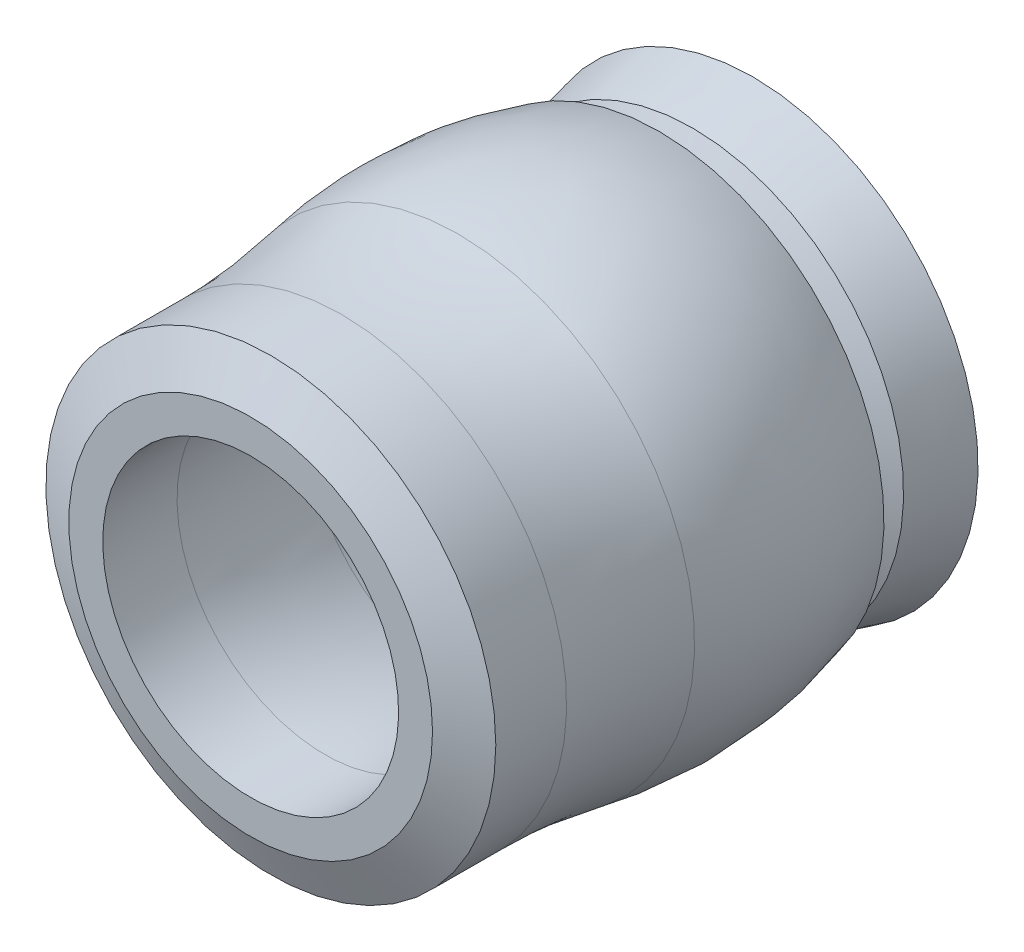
ISO-10303-21;
HEADER;
FILE_DESCRIPTION(('STEP AP214'),'2;1');
FILE_NAME('part.step','',(''),(''),'','','');
FILE_SCHEMA(('AUTOMOTIVE_DESIGN { 1 0 10303 214 1 1 1 1 }'));
ENDSEC;
DATA;
#1=APPLICATION_CONTEXT('core data for automotive mechanical design processes');
#2=APPLICATION_PROTOCOL_DEFINITION('international standard','automotive_design',2000,#1);
#3=PRODUCT_CONTEXT('',#1,'mechanical');
#4=PRODUCT('Part','Part','',(#3));
#5=PRODUCT_RELATED_PRODUCT_CATEGORY('part','',(#4));
#6=PRODUCT_DEFINITION_FORMATION('','',#4);
#7=PRODUCT_DEFINITION_CONTEXT('part definition',#1,'design');
#8=PRODUCT_DEFINITION('design','',#6,#7);
#9=PRODUCT_DEFINITION_SHAPE('','',#8);
#10=(LENGTH_UNIT() NAMED_UNIT(*) SI_UNIT(.MILLI.,.METRE.));
#11=(NAMED_UNIT(*) PLANE_ANGLE_UNIT() SI_UNIT($,.RADIAN.));
#12=(NAMED_UNIT(*) SI_UNIT($,.STERADIAN.) SOLID_ANGLE_UNIT());
#13=UNCERTAINTY_MEASURE_WITH_UNIT(LENGTH_MEASURE(1.E-05),#10,'distance_accuracy_value','');
#14=(GEOMETRIC_REPRESENTATION_CONTEXT(3) GLOBAL_UNCERTAINTY_ASSIGNED_CONTEXT((#13)) GLOBAL_UNIT_ASSIGNED_CONTEXT((#10,
#11,#12)) REPRESENTATION_CONTEXT('',''));
#15=CARTESIAN_POINT('',(0.,0.,0.));
#16=DIRECTION('',(0.,0.,1.));
#17=DIRECTION('',(1.,0.,0.));
#18=AXIS2_PLACEMENT_3D('',#15,#16,#17);
#19=CARTESIAN_POINT('',(0.,0.,3.61389850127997));
#20=DIRECTION('',(0.,0.,-1.));
#21=DIRECTION('',(0.,1.,0.));
#22=AXIS2_PLACEMENT_3D('',#19,#20,#21);
#23=TOROIDAL_SURFACE('',#22,7.366,1.27);
#24=CARTESIAN_POINT('',(0.,0.,3.61389850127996));
#25=DIRECTION('',(0.,0.,-1.));
#26=DIRECTION('',(0.,1.,0.));
#27=AXIS2_PLACEMENT_3D('',#24,#25,#26);
#28=CIRCLE('',#27,6.096);
#29=CARTESIAN_POINT('',(0.,6.096,3.61389850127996));
#30=VERTEX_POINT('',#29);
#31=EDGE_CURVE('E97',#30,#30,#28,.T.);
#32=ORIENTED_EDGE('',*,*,#31,.T.);
#33=EDGE_LOOP('',(#32));
#34=FACE_BOUND('',#33,.T.);
#35=CARTESIAN_POINT('',(0.,0.,3.99017181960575));
#36=DIRECTION('',(0.,0.,-1.));
#37=DIRECTION('',(0.,1.,0.));
#38=AXIS2_PLACEMENT_3D('',#35,#36,#37);
#39=CIRCLE('',#38,6.15302086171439);
#40=CARTESIAN_POINT('',(0.,6.15302086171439,3.99017181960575));
#41=VERTEX_POINT('',#40);
#42=EDGE_CURVE('E158',#41,#41,#39,.F.);
#43=ORIENTED_EDGE('',*,*,#42,.T.);
#44=EDGE_LOOP('',(#43));
#45=FACE_BOUND('',#44,.T.);
#46=ADVANCED_FACE('F12',(#34,#45),#23,.T.);
#47=CARTESIAN_POINT('',(0.,-9.64238390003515,8.89));
#48=DIRECTION('',(1.,0.,0.));
#49=DIRECTION('',(0.,1.,0.));
#50=AXIS2_PLACEMENT_3D('',#47,#48,#49);
#51=CIRCLE('',#50,16.5379299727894);
#52=TRIMMED_CURVE('',#51,(PARAMETER_VALUE(-0.948322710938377)),
(PARAMETER_VALUE(0.948322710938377)),.T.,.PARAMETER.);
#53=CARTESIAN_POINT('',(0.,0.,8.89));
#54=DIRECTION('',(0.,0.,-1.));
#55=AXIS1_PLACEMENT('',#53,#54);
#56=SURFACE_OF_REVOLUTION('',#52,#55);
#57=ORIENTED_EDGE('',*,*,#42,.F.);
#58=EDGE_LOOP('',(#57));
#59=FACE_BOUND('',#58,.T.);
#60=CARTESIAN_POINT('',(0.,0.,11.8870457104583));
#61=DIRECTION('',(0.,0.,-1.));
#62=DIRECTION('',(0.,1.,0.));
#63=AXIS2_PLACEMENT_3D('',#60,#61,#62);
#64=CIRCLE('',#63,6.62171290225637);
#65=CARTESIAN_POINT('',(0.,6.62171290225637,11.8870457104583));
#66=VERTEX_POINT('',#65);
#67=EDGE_CURVE('E94',#66,#66,#64,.T.);
#68=ORIENTED_EDGE('',*,*,#67,.F.);
#69=EDGE_LOOP('',(#68));
#70=FACE_BOUND('',#69,.T.);
#71=ADVANCED_FACE('F101',(#59,#70),#56,.T.);
#72=CARTESIAN_POINT('',(0.,0.,-2.63431461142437));
#73=DIRECTION('',(0.,0.,-1.));
#74=DIRECTION('',(0.,1.,0.));
#75=AXIS2_PLACEMENT_3D('',#72,#73,#74);
#76=CYLINDRICAL_SURFACE('',#75,6.096);
#77=CARTESIAN_POINT('',(0.,0.,3.53405823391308));
#78=DIRECTION('',(0.,0.,1.));
#79=DIRECTION('',(0.,-1.,0.));
#80=AXIS2_PLACEMENT_3D('',#77,#78,#79);
#81=CIRCLE('',#80,6.0959999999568);
#82=CARTESIAN_POINT('',(0.,-6.0959999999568,3.53405823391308));
#83=VERTEX_POINT('',#82);
#84=EDGE_CURVE('E91',#83,#83,#81,.F.);
#85=ORIENTED_EDGE('',*,*,#84,.T.);
#86=EDGE_LOOP('',(#85));
#87=FACE_BOUND('',#86,.T.);
#88=ORIENTED_EDGE('',*,*,#31,.F.);
#89=EDGE_LOOP('',(#88));
#90=FACE_BOUND('',#89,.T.);
#91=ADVANCED_FACE('F84',(#87,#90),#76,.F.);
#92=CARTESIAN_POINT('',(0.,0.,17.6408614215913));
#93=DIRECTION('',(0.,0.,-1.));
#94=DIRECTION('',(0.,1.,0.));
#95=AXIS2_PLACEMENT_3D('',#92,#93,#94);
#96=TOROIDAL_SURFACE('',#95,37.846,31.75);
#97=ORIENTED_EDGE('',*,*,#67,.T.);
#98=EDGE_LOOP('',(#97));
#99=FACE_BOUND('',#98,.T.);
#100=CARTESIAN_POINT('',(0.,0.,17.6408614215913));
#101=DIRECTION('',(0.,0.,-1.));
#102=DIRECTION('',(0.,1.,0.));
#103=AXIS2_PLACEMENT_3D('',#100,#101,#102);
#104=CIRCLE('',#103,6.096);
#105=CARTESIAN_POINT('',(0.,6.096,17.6408614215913));
#106=VERTEX_POINT('',#105);
#107=EDGE_CURVE('E89',#106,#106,#104,.F.);
#108=ORIENTED_EDGE('',*,*,#107,.T.);
#109=EDGE_LOOP('',(#108));
#110=FACE_BOUND('',#109,.T.);
#111=ADVANCED_FACE('F79',(#99,#110),#96,.T.);
#112=CARTESIAN_POINT('',(0.,0.,3.53405823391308));
#113=DIRECTION('',(0.,0.,1.));
#114=DIRECTION('',(0.,-1.,0.));
#115=AXIS2_PLACEMENT_3D('',#112,#113,#114);
#116=CONICAL_SURFACE('',#115,6.0959999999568,1.13446401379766);
#117=ORIENTED_EDGE('',*,*,#84,.F.);
#118=EDGE_LOOP('',(#117));
#119=FACE_BOUND('',#118,.T.);
#120=CARTESIAN_POINT('',(0.,0.,2.5273));
#121=DIRECTION('',(0.,0.,-1.));
#122=DIRECTION('',(0.,1.,0.));
#123=AXIS2_PLACEMENT_3D('',#120,#121,#122);
#124=CIRCLE('',#123,3.937);
#125=CARTESIAN_POINT('',(0.,3.937,2.5273));
#126=VERTEX_POINT('',#125);
#127=EDGE_CURVE('E138',#126,#126,#124,.T.);
#128=ORIENTED_EDGE('',*,*,#127,.T.);
#129=EDGE_LOOP('',(#128));
#130=FACE_BOUND('',#129,.T.);
#131=ADVANCED_FACE('F75',(#119,#130),#116,.F.);
#132=CARTESIAN_POINT('',(0.,0.,-2.63431461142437));
#133=DIRECTION('',(0.,0.,-1.));
#134=DIRECTION('',(0.,1.,0.));
#135=AXIS2_PLACEMENT_3D('',#132,#133,#134);
#136=CYLINDRICAL_SURFACE('',#135,6.096);
#137=ORIENTED_EDGE('',*,*,#107,.F.);
#138=EDGE_LOOP('',(#137));
#139=FACE_BOUND('',#138,.T.);
#140=CARTESIAN_POINT('',(0.,0.,20.701));
#141=DIRECTION('',(0.,0.,-1.));
#142=DIRECTION('',(0.,1.,0.));
#143=AXIS2_PLACEMENT_3D('',#140,#141,#142);
#144=CIRCLE('',#143,6.096);
#145=CARTESIAN_POINT('',(0.,6.096,20.701));
#146=VERTEX_POINT('',#145);
#147=EDGE_CURVE('E16',#146,#146,#144,.T.);
#148=ORIENTED_EDGE('',*,*,#147,.F.);
#149=EDGE_LOOP('',(#148));
#150=FACE_BOUND('',#149,.T.);
#151=ADVANCED_FACE('F71',(#139,#150),#136,.F.);
#152=CARTESIAN_POINT('',(0.,0.,-2.63431461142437));
#153=DIRECTION('',(0.,0.,-1.));
#154=DIRECTION('',(0.,1.,0.));
#155=AXIS2_PLACEMENT_3D('',#152,#153,#154);
#156=CYLINDRICAL_SURFACE('',#155,3.937);
#157=CARTESIAN_POINT('',(0.,0.,0.));
#158=DIRECTION('',(0.,0.,-1.));
#159=DIRECTION('',(0.,1.,0.));
#160=AXIS2_PLACEMENT_3D('',#157,#158,#159);
#161=CIRCLE('',#160,3.937);
#162=CARTESIAN_POINT('',(0.,3.937,0.));
#163=VERTEX_POINT('',#162);
#164=EDGE_CURVE('E143',#163,#163,#161,.F.);
#165=ORIENTED_EDGE('',*,*,#164,.F.);
#166=EDGE_LOOP('',(#165));
#167=FACE_BOUND('',#166,.T.);
#168=ORIENTED_EDGE('',*,*,#127,.F.);
#169=EDGE_LOOP('',(#168));
#170=FACE_BOUND('',#169,.T.);
#171=ADVANCED_FACE('F67',(#167,#170),#156,.F.);
#172=CARTESIAN_POINT('',(7.493,0.,20.701));
#173=DIRECTION('',(0.,0.,1.));
#174=DIRECTION('',(0.,-1.,0.));
#175=AXIS2_PLACEMENT_3D('',#172,#173,#174);
#176=PLANE('',#175);
#177=CARTESIAN_POINT('',(0.,0.,20.701));
#178=DIRECTION('',(0.,0.,-1.));
#179=DIRECTION('',(1.,0.,0.));
#180=AXIS2_PLACEMENT_3D('',#177,#178,#179);
#181=CIRCLE('',#180,7.493);
#182=CARTESIAN_POINT('',(7.493,0.,20.701));
#183=VERTEX_POINT('',#182);
#184=EDGE_CURVE('E151',#183,#183,#181,.T.);
#185=ORIENTED_EDGE('',*,*,#184,.F.);
#186=EDGE_LOOP('',(#185));
#187=FACE_BOUND('',#186,.T.);
#188=ORIENTED_EDGE('',*,*,#147,.T.);
#189=EDGE_LOOP('',(#188));
#190=FACE_BOUND('',#189,.T.);
#191=ADVANCED_FACE('F63',(#187,#190),#176,.T.);
#192=CARTESIAN_POINT('',(3.937,0.,0.));
#193=DIRECTION('',(0.,0.,-1.));
#194=DIRECTION('',(0.,1.,0.));
#195=AXIS2_PLACEMENT_3D('',#192,#193,#194);
#196=PLANE('',#195);
#197=ORIENTED_EDGE('',*,*,#164,.T.);
#198=EDGE_LOOP('',(#197));
#199=FACE_BOUND('',#198,.T.);
#200=CARTESIAN_POINT('',(0.,0.,0.));
#201=DIRECTION('',(0.,0.,-1.));
#202=DIRECTION('',(0.,1.,0.));
#203=AXIS2_PLACEMENT_3D('',#200,#201,#202);
#204=CIRCLE('',#203,9.271);
#205=CARTESIAN_POINT('',(0.,9.271,0.));
#206=VERTEX_POINT('',#205);
#207=EDGE_CURVE('E136',#206,#206,#204,.F.);
#208=ORIENTED_EDGE('',*,*,#207,.F.);
#209=EDGE_LOOP('',(#208));
#210=FACE_BOUND('',#209,.T.);
#211=ADVANCED_FACE('F59',(#199,#210),#196,.T.);
#212=CARTESIAN_POINT('',(0.,0.,19.8719049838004));
#213=DIRECTION('',(0.,0.,-1.));
#214=DIRECTION('',(1.,0.,0.));
#215=AXIS2_PLACEMENT_3D('',#212,#213,#214);
#216=CONICAL_SURFACE('',#215,9.271,1.13446401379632);
#217=ORIENTED_EDGE('',*,*,#184,.T.);
#218=EDGE_LOOP('',(#217));
#219=FACE_BOUND('',#218,.T.);
#220=CARTESIAN_POINT('',(0.,0.,19.8719049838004));
#221=DIRECTION('',(0.,0.,-1.));
#222=DIRECTION('',(0.,1.,0.));
#223=AXIS2_PLACEMENT_3D('',#220,#221,#222);
#224=CIRCLE('',#223,9.271);
#225=CARTESIAN_POINT('',(0.,9.271,19.8719049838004));
#226=VERTEX_POINT('',#225);
#227=EDGE_CURVE('E133',#226,#226,#224,.T.);
#228=ORIENTED_EDGE('',*,*,#227,.F.);
#229=EDGE_LOOP('',(#228));
#230=FACE_BOUND('',#229,.T.);
#231=ADVANCED_FACE('F55',(#219,#230),#216,.T.);
#232=CARTESIAN_POINT('',(0.,0.,0.));
#233=DIRECTION('',(0.,0.,-1.));
#234=DIRECTION('',(0.,1.,0.));
#235=AXIS2_PLACEMENT_3D('',#232,#233,#234);
#236=CONICAL_SURFACE('',#235,9.271,0.228705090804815);
#237=CARTESIAN_POINT('',(0.,0.,2.48908552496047));
#238=DIRECTION('',(0.,0.,-1.));
#239=DIRECTION('',(0.,1.,0.));
#240=AXIS2_PLACEMENT_3D('',#237,#238,#239);
#241=CIRCLE('',#240,8.69159595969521);
#242=CARTESIAN_POINT('',(0.,8.69159595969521,2.48908552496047));
#243=VERTEX_POINT('',#242);
#244=EDGE_CURVE('E132',#243,#243,#241,.F.);
#245=ORIENTED_EDGE('',*,*,#244,.F.);
#246=EDGE_LOOP('',(#245));
#247=FACE_BOUND('',#246,.T.);
#248=ORIENTED_EDGE('',*,*,#207,.T.);
#249=EDGE_LOOP('',(#248));
#250=FACE_BOUND('',#249,.T.);
#251=ADVANCED_FACE('F51',(#247,#250),#236,.T.);
#252=CARTESIAN_POINT('',(0.,0.,-2.63431461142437));
#253=DIRECTION('',(0.,0.,-1.));
#254=DIRECTION('',(0.,1.,0.));
#255=AXIS2_PLACEMENT_3D('',#252,#253,#254);
#256=CYLINDRICAL_SURFACE('',#255,9.271);
#257=ORIENTED_EDGE('',*,*,#227,.T.);
#258=EDGE_LOOP('',(#257));
#259=FACE_BOUND('',#258,.T.);
#260=CARTESIAN_POINT('',(0.,0.,16.9522468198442));
#261=DIRECTION('',(0.,0.,-1.));
#262=DIRECTION('',(0.,1.,0.));
#263=AXIS2_PLACEMENT_3D('',#260,#261,#262);
#264=CIRCLE('',#263,9.271);
#265=CARTESIAN_POINT('',(0.,9.271,16.9522468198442));
#266=VERTEX_POINT('',#265);
#267=EDGE_CURVE('E32',#266,#266,#264,.F.);
#268=ORIENTED_EDGE('',*,*,#267,.T.);
#269=EDGE_LOOP('',(#268));
#270=FACE_BOUND('',#269,.T.);
#271=ADVANCED_FACE('F47',(#259,#270),#256,.T.);
#272=CARTESIAN_POINT('',(0.,0.,2.48908552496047));
#273=DIRECTION('',(0.,0.,-1.));
#274=DIRECTION('',(0.,1.,0.));
#275=AXIS2_PLACEMENT_3D('',#272,#273,#274);
#276=CONICAL_SURFACE('',#275,8.69159595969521,1.13446401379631);
#277=CARTESIAN_POINT('',(0.,0.,3.048));
#278=DIRECTION('',(0.,0.,1.));
#279=DIRECTION('',(0.,-1.,0.));
#280=AXIS2_PLACEMENT_3D('',#277,#278,#279);
#281=CIRCLE('',#280,7.493);
#282=CARTESIAN_POINT('',(0.,-7.493,3.048));
#283=VERTEX_POINT('',#282);
#284=EDGE_CURVE('E25',#283,#283,#281,.T.);
#285=ORIENTED_EDGE('',*,*,#284,.F.);
#286=EDGE_LOOP('',(#285));
#287=FACE_BOUND('',#286,.T.);
#288=ORIENTED_EDGE('',*,*,#244,.T.);
#289=EDGE_LOOP('',(#288));
#290=FACE_BOUND('',#289,.T.);
#291=ADVANCED_FACE('F42',(#287,#290),#276,.T.);
#292=CARTESIAN_POINT('',(0.,0.,16.9522468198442));
#293=DIRECTION('',(0.,0.,-1.));
#294=DIRECTION('',(0.,1.,0.));
#295=AXIS2_PLACEMENT_3D('',#292,#293,#294);
#296=TOROIDAL_SURFACE('',#295,34.671,25.4);
#297=ORIENTED_EDGE('',*,*,#267,.F.);
#298=EDGE_LOOP('',(#297));
#299=FACE_BOUND('',#298,.T.);
#300=CARTESIAN_POINT('',(0.,0.,12.1394939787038));
#301=DIRECTION('',(0.,0.,-1.));
#302=DIRECTION('',(0.,1.,0.));
#303=AXIS2_PLACEMENT_3D('',#300,#301,#302);
#304=CIRCLE('',#303,9.7311240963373);
#305=CARTESIAN_POINT('',(0.,9.7311240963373,12.1394939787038));
#306=VERTEX_POINT('',#305);
#307=EDGE_CURVE('E20',#306,#306,#304,.T.);
#308=ORIENTED_EDGE('',*,*,#307,.F.);
#309=EDGE_LOOP('',(#308));
#310=FACE_BOUND('',#309,.T.);
#311=ADVANCED_FACE('F37',(#299,#310),#296,.F.);
#312=CARTESIAN_POINT('',(0.,0.,3.8770950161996));
#313=DIRECTION('',(0.,0.,1.));
#314=DIRECTION('',(0.,-1.,0.));
#315=AXIS2_PLACEMENT_3D('',#312,#313,#314);
#316=CONICAL_SURFACE('',#315,9.271,1.13446401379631);
#317=ORIENTED_EDGE('',*,*,#284,.T.);
#318=EDGE_LOOP('',(#317));
#319=FACE_BOUND('',#318,.T.);
#320=CARTESIAN_POINT('',(0.,0.,3.8770950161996));
#321=DIRECTION('',(0.,0.,-1.));
#322=DIRECTION('',(0.,1.,0.));
#323=AXIS2_PLACEMENT_3D('',#320,#321,#322);
#324=CIRCLE('',#323,9.271);
#325=CARTESIAN_POINT('',(0.,9.271,3.8770950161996));
#326=VERTEX_POINT('',#325);
#327=EDGE_CURVE('E8',#326,#326,#324,.F.);
#328=ORIENTED_EDGE('',*,*,#327,.F.);
#329=EDGE_LOOP('',(#328));
#330=FACE_BOUND('',#329,.T.);
#331=ADVANCED_FACE('F41',(#319,#330),#316,.T.);
#332=CARTESIAN_POINT('',(0.,-6.93403792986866,8.9235475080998));
#333=DIRECTION('',(1.,0.,0.));
#334=DIRECTION('',(0.,1.,0.));
#335=AXIS2_PLACEMENT_3D('',#332,#333,#334);
#336=CIRCLE('',#335,16.9726231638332);
#337=TRIMMED_CURVE('',#336,(PARAMETER_VALUE(-1.14993967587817)),
(PARAMETER_VALUE(1.14993967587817)),.T.,.PARAMETER.);
#338=CARTESIAN_POINT('',(0.,0.,8.9235475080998));
#339=DIRECTION('',(0.,0.,-1.));
#340=AXIS1_PLACEMENT('',#338,#339);
#341=SURFACE_OF_REVOLUTION('',#337,#340);
#342=ORIENTED_EDGE('',*,*,#307,.T.);
#343=EDGE_LOOP('',(#342));
#344=FACE_BOUND('',#343,.T.);
#345=ORIENTED_EDGE('',*,*,#327,.T.);
#346=EDGE_LOOP('',(#345));
#347=FACE_BOUND('',#346,.T.);
#348=ADVANCED_FACE('F114',(#344,#347),#341,.F.);
#349=CLOSED_SHELL('',(#46,#71,#91,#111,#131,#151,#171,#191,#211,#231,#251,#271,#291,#311,#331,#348));
#350=MANIFOLD_SOLID_BREP('B1',#349);
#351=ADVANCED_BREP_SHAPE_REPRESENTATION('',(#18,#350),#14);
#352=SHAPE_DEFINITION_REPRESENTATION(#9,#351);
ENDSEC;
END-ISO-10303-21;
